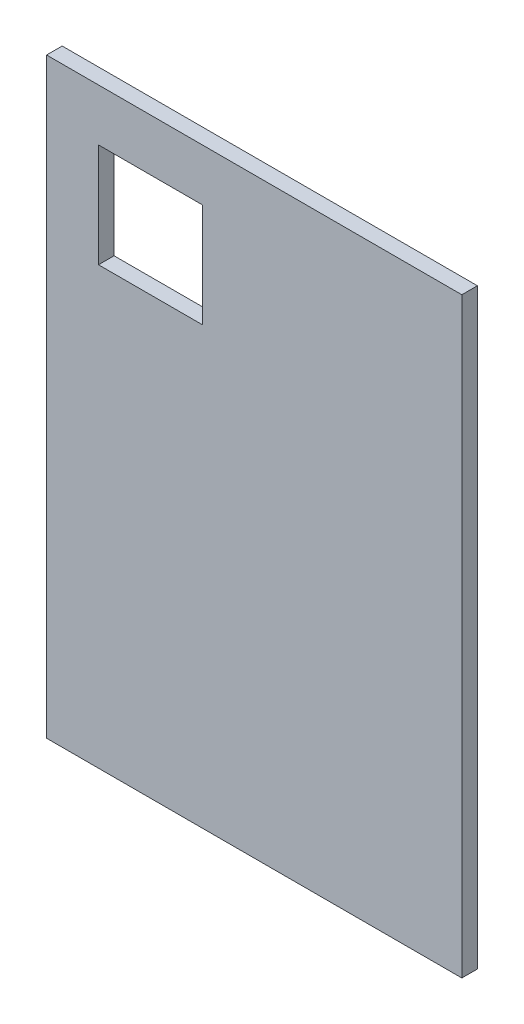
ISO-10303-21;
HEADER;
FILE_DESCRIPTION(('STEP AP214'),'2;1');
FILE_NAME('part.step','',(''),(''),'','','');
FILE_SCHEMA(('AUTOMOTIVE_DESIGN { 1 0 10303 214 1 1 1 1 }'));
ENDSEC;
DATA;
#1=APPLICATION_CONTEXT('core data for automotive mechanical design processes');
#2=APPLICATION_PROTOCOL_DEFINITION('international standard','automotive_design',2000,#1);
#3=PRODUCT_CONTEXT('',#1,'mechanical');
#4=PRODUCT('Part','Part','',(#3));
#5=PRODUCT_RELATED_PRODUCT_CATEGORY('part','',(#4));
#6=PRODUCT_DEFINITION_FORMATION('','',#4);
#7=PRODUCT_DEFINITION_CONTEXT('part definition',#1,'design');
#8=PRODUCT_DEFINITION('design','',#6,#7);
#9=PRODUCT_DEFINITION_SHAPE('','',#8);
#10=(LENGTH_UNIT() NAMED_UNIT(*) SI_UNIT(.MILLI.,.METRE.));
#11=(NAMED_UNIT(*) PLANE_ANGLE_UNIT() SI_UNIT($,.RADIAN.));
#12=(NAMED_UNIT(*) SI_UNIT($,.STERADIAN.) SOLID_ANGLE_UNIT());
#13=UNCERTAINTY_MEASURE_WITH_UNIT(LENGTH_MEASURE(1.E-05),#10,'distance_accuracy_value','');
#14=(GEOMETRIC_REPRESENTATION_CONTEXT(3) GLOBAL_UNCERTAINTY_ASSIGNED_CONTEXT((#13)) GLOBAL_UNIT_ASSIGNED_CONTEXT((#10,
#11,#12)) REPRESENTATION_CONTEXT('',''));
#15=CARTESIAN_POINT('',(0.,0.,0.));
#16=DIRECTION('',(0.,0.,1.));
#17=DIRECTION('',(1.,0.,0.));
#18=AXIS2_PLACEMENT_3D('',#15,#16,#17);
#19=CARTESIAN_POINT('',(200.,285.,15.));
#20=DIRECTION('',(-1.,0.,0.));
#21=DIRECTION('',(0.,-1.,0.));
#22=AXIS2_PLACEMENT_3D('',#19,#20,#21);
#23=PLANE('',#22);
#24=DIRECTION('',(0.,1.,0.));
#25=VECTOR('',#24,1.);
#26=CARTESIAN_POINT('',(200.,285.,0.));
#27=LINE('',#26,#25);
#28=CARTESIAN_POINT('',(200.,-285.,0.));
#29=VERTEX_POINT('',#28);
#30=CARTESIAN_POINT('',(200.,285.,0.));
#31=VERTEX_POINT('',#30);
#32=EDGE_CURVE('E151',#29,#31,#27,.T.);
#33=ORIENTED_EDGE('',*,*,#32,.T.);
#34=DIRECTION('',(0.,0.,-1.));
#35=VECTOR('',#34,1.);
#36=CARTESIAN_POINT('',(200.,285.,15.));
#37=LINE('',#36,#35);
#38=CARTESIAN_POINT('',(200.,285.,15.));
#39=VERTEX_POINT('',#38);
#40=EDGE_CURVE('E11',#39,#31,#37,.T.);
#41=ORIENTED_EDGE('',*,*,#40,.F.);
#42=DIRECTION('',(0.,1.,0.));
#43=VECTOR('',#42,1.);
#44=CARTESIAN_POINT('',(200.,285.,15.));
#45=LINE('',#44,#43);
#46=CARTESIAN_POINT('',(200.,-285.,15.));
#47=VERTEX_POINT('',#46);
#48=EDGE_CURVE('E157',#47,#39,#45,.T.);
#49=ORIENTED_EDGE('',*,*,#48,.F.);
#50=DIRECTION('',(0.,0.,-1.));
#51=VECTOR('',#50,1.);
#52=CARTESIAN_POINT('',(200.,-285.,15.));
#53=LINE('',#52,#51);
#54=EDGE_CURVE('E171',#47,#29,#53,.T.);
#55=ORIENTED_EDGE('',*,*,#54,.T.);
#56=EDGE_LOOP('',(#33,#41,#49,#55));
#57=FACE_BOUND('',#56,.T.);
#58=ADVANCED_FACE('F43',(#57),#23,.F.);
#59=CARTESIAN_POINT('',(-200.,285.,15.));
#60=DIRECTION('',(0.,-1.,0.));
#61=DIRECTION('',(0.,0.,-1.));
#62=AXIS2_PLACEMENT_3D('',#59,#60,#61);
#63=PLANE('',#62);
#64=DIRECTION('',(-1.,0.,0.));
#65=VECTOR('',#64,1.);
#66=CARTESIAN_POINT('',(-200.,285.,0.));
#67=LINE('',#66,#65);
#68=CARTESIAN_POINT('',(-200.,285.,0.));
#69=VERTEX_POINT('',#68);
#70=EDGE_CURVE('E175',#31,#69,#67,.T.);
#71=ORIENTED_EDGE('',*,*,#70,.T.);
#72=DIRECTION('',(0.,0.,-1.));
#73=VECTOR('',#72,1.);
#74=CARTESIAN_POINT('',(-200.,285.,15.));
#75=LINE('',#74,#73);
#76=CARTESIAN_POINT('',(-200.,285.,15.));
#77=VERTEX_POINT('',#76);
#78=EDGE_CURVE('E51',#77,#69,#75,.T.);
#79=ORIENTED_EDGE('',*,*,#78,.F.);
#80=DIRECTION('',(-1.,0.,0.));
#81=VECTOR('',#80,1.);
#82=CARTESIAN_POINT('',(-200.,285.,15.));
#83=LINE('',#82,#81);
#84=EDGE_CURVE('E161',#39,#77,#83,.T.);
#85=ORIENTED_EDGE('',*,*,#84,.F.);
#86=ORIENTED_EDGE('',*,*,#40,.T.);
#87=EDGE_LOOP('',(#71,#79,#85,#86));
#88=FACE_BOUND('',#87,.T.);
#89=ADVANCED_FACE('F209',(#88),#63,.F.);
#90=CARTESIAN_POINT('',(-200.,285.,15.));
#91=DIRECTION('',(1.,0.,0.));
#92=DIRECTION('',(0.,1.,0.));
#93=AXIS2_PLACEMENT_3D('',#90,#91,#92);
#94=PLANE('',#93);
#95=DIRECTION('',(0.,-1.,0.));
#96=VECTOR('',#95,1.);
#97=CARTESIAN_POINT('',(-200.,285.,0.));
#98=LINE('',#97,#96);
#99=CARTESIAN_POINT('',(-200.,-285.,0.));
#100=VERTEX_POINT('',#99);
#101=EDGE_CURVE('E178',#69,#100,#98,.T.);
#102=ORIENTED_EDGE('',*,*,#101,.T.);
#103=DIRECTION('',(0.,0.,-1.));
#104=VECTOR('',#103,1.);
#105=CARTESIAN_POINT('',(-200.,-285.,15.));
#106=LINE('',#105,#104);
#107=CARTESIAN_POINT('',(-200.,-285.,15.));
#108=VERTEX_POINT('',#107);
#109=EDGE_CURVE('E186',#108,#100,#106,.T.);
#110=ORIENTED_EDGE('',*,*,#109,.F.);
#111=DIRECTION('',(0.,-1.,0.));
#112=VECTOR('',#111,1.);
#113=CARTESIAN_POINT('',(-200.,285.,15.));
#114=LINE('',#113,#112);
#115=EDGE_CURVE('E165',#77,#108,#114,.T.);
#116=ORIENTED_EDGE('',*,*,#115,.F.);
#117=ORIENTED_EDGE('',*,*,#78,.T.);
#118=EDGE_LOOP('',(#102,#110,#116,#117));
#119=FACE_BOUND('',#118,.T.);
#120=ADVANCED_FACE('F195',(#119),#94,.F.);
#121=CARTESIAN_POINT('',(-200.,-285.,15.));
#122=DIRECTION('',(0.,1.,0.));
#123=DIRECTION('',(0.,0.,1.));
#124=AXIS2_PLACEMENT_3D('',#121,#122,#123);
#125=PLANE('',#124);
#126=DIRECTION('',(1.,0.,0.));
#127=VECTOR('',#126,1.);
#128=CARTESIAN_POINT('',(-200.,-285.,0.));
#129=LINE('',#128,#127);
#130=EDGE_CURVE('E162',#100,#29,#129,.T.);
#131=ORIENTED_EDGE('',*,*,#130,.T.);
#132=ORIENTED_EDGE('',*,*,#54,.F.);
#133=DIRECTION('',(1.,0.,0.));
#134=VECTOR('',#133,1.);
#135=CARTESIAN_POINT('',(-200.,-285.,15.));
#136=LINE('',#135,#134);
#137=EDGE_CURVE('E168',#108,#47,#136,.T.);
#138=ORIENTED_EDGE('',*,*,#137,.F.);
#139=ORIENTED_EDGE('',*,*,#109,.T.);
#140=EDGE_LOOP('',(#131,#132,#138,#139));
#141=FACE_BOUND('',#140,.T.);
#142=ADVANCED_FACE('F202',(#141),#125,.F.);
#143=CARTESIAN_POINT('',(0.,0.,15.));
#144=DIRECTION('',(0.,0.,1.));
#145=DIRECTION('',(1.,0.,0.));
#146=AXIS2_PLACEMENT_3D('',#143,#144,#145);
#147=PLANE('',#146);
#148=DIRECTION('',(0.,1.,0.));
#149=VECTOR('',#148,1.);
#150=CARTESIAN_POINT('',(-50.0000000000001,235.,15.));
#151=LINE('',#150,#149);
#152=CARTESIAN_POINT('',(-50.0000000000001,135.,15.));
#153=VERTEX_POINT('',#152);
#154=CARTESIAN_POINT('',(-50.0000000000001,235.,15.));
#155=VERTEX_POINT('',#154);
#156=EDGE_CURVE('E58',#153,#155,#151,.T.);
#157=ORIENTED_EDGE('',*,*,#156,.F.);
#158=DIRECTION('',(1.,0.,0.));
#159=VECTOR('',#158,1.);
#160=CARTESIAN_POINT('',(-150.,135.,15.));
#161=LINE('',#160,#159);
#162=CARTESIAN_POINT('',(-150.,135.,15.));
#163=VERTEX_POINT('',#162);
#164=EDGE_CURVE('E129',#163,#153,#161,.T.);
#165=ORIENTED_EDGE('',*,*,#164,.F.);
#166=DIRECTION('',(0.,-1.,0.));
#167=VECTOR('',#166,1.);
#168=CARTESIAN_POINT('',(-150.,235.,15.));
#169=LINE('',#168,#167);
#170=CARTESIAN_POINT('',(-150.,235.,15.));
#171=VERTEX_POINT('',#170);
#172=EDGE_CURVE('E133',#171,#163,#169,.T.);
#173=ORIENTED_EDGE('',*,*,#172,.F.);
#174=DIRECTION('',(-1.,0.,0.));
#175=VECTOR('',#174,1.);
#176=CARTESIAN_POINT('',(-150.,235.,15.));
#177=LINE('',#176,#175);
#178=EDGE_CURVE('E142',#155,#171,#177,.T.);
#179=ORIENTED_EDGE('',*,*,#178,.F.);
#180=EDGE_LOOP('',(#157,#165,#173,#179));
#181=FACE_BOUND('',#180,.T.);
#182=ORIENTED_EDGE('',*,*,#48,.T.);
#183=ORIENTED_EDGE('',*,*,#84,.T.);
#184=ORIENTED_EDGE('',*,*,#115,.T.);
#185=ORIENTED_EDGE('',*,*,#137,.T.);
#186=EDGE_LOOP('',(#182,#183,#184,#185));
#187=FACE_BOUND('',#186,.T.);
#188=ADVANCED_FACE('F208',(#181,#187),#147,.T.);
#189=CARTESIAN_POINT('',(0.,0.,0.));
#190=DIRECTION('',(0.,0.,1.));
#191=DIRECTION('',(1.,0.,0.));
#192=AXIS2_PLACEMENT_3D('',#189,#190,#191);
#193=PLANE('',#192);
#194=DIRECTION('',(1.,0.,0.));
#195=VECTOR('',#194,1.);
#196=CARTESIAN_POINT('',(-150.,135.,0.));
#197=LINE('',#196,#195);
#198=CARTESIAN_POINT('',(-150.,135.,0.));
#199=VERTEX_POINT('',#198);
#200=CARTESIAN_POINT('',(-50.0000000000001,135.,0.));
#201=VERTEX_POINT('',#200);
#202=EDGE_CURVE('E117',#199,#201,#197,.T.);
#203=ORIENTED_EDGE('',*,*,#202,.T.);
#204=DIRECTION('',(0.,1.,0.));
#205=VECTOR('',#204,1.);
#206=CARTESIAN_POINT('',(-50.0000000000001,235.,0.));
#207=LINE('',#206,#205);
#208=CARTESIAN_POINT('',(-50.0000000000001,235.,0.));
#209=VERTEX_POINT('',#208);
#210=EDGE_CURVE('E110',#201,#209,#207,.T.);
#211=ORIENTED_EDGE('',*,*,#210,.T.);
#212=DIRECTION('',(-1.,0.,0.));
#213=VECTOR('',#212,1.);
#214=CARTESIAN_POINT('',(-150.,235.,0.));
#215=LINE('',#214,#213);
#216=CARTESIAN_POINT('',(-150.,235.,0.));
#217=VERTEX_POINT('',#216);
#218=EDGE_CURVE('E120',#209,#217,#215,.T.);
#219=ORIENTED_EDGE('',*,*,#218,.T.);
#220=DIRECTION('',(0.,-1.,0.));
#221=VECTOR('',#220,1.);
#222=CARTESIAN_POINT('',(-150.,235.,0.));
#223=LINE('',#222,#221);
#224=EDGE_CURVE('E66',#217,#199,#223,.T.);
#225=ORIENTED_EDGE('',*,*,#224,.T.);
#226=EDGE_LOOP('',(#203,#211,#219,#225));
#227=FACE_BOUND('',#226,.T.);
#228=ORIENTED_EDGE('',*,*,#32,.F.);
#229=ORIENTED_EDGE('',*,*,#130,.F.);
#230=ORIENTED_EDGE('',*,*,#101,.F.);
#231=ORIENTED_EDGE('',*,*,#70,.F.);
#232=EDGE_LOOP('',(#228,#229,#230,#231));
#233=FACE_BOUND('',#232,.T.);
#234=ADVANCED_FACE('F125',(#227,#233),#193,.F.);
#235=CARTESIAN_POINT('',(-50.0000000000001,235.,0.));
#236=DIRECTION('',(1.,0.,0.));
#237=DIRECTION('',(0.,0.,-1.));
#238=AXIS2_PLACEMENT_3D('',#235,#236,#237);
#239=PLANE('',#238);
#240=ORIENTED_EDGE('',*,*,#156,.T.);
#241=DIRECTION('',(0.,0.,1.));
#242=VECTOR('',#241,1.);
#243=CARTESIAN_POINT('',(-50.0000000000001,235.,0.));
#244=LINE('',#243,#242);
#245=EDGE_CURVE('E106',#209,#155,#244,.T.);
#246=ORIENTED_EDGE('',*,*,#245,.F.);
#247=ORIENTED_EDGE('',*,*,#210,.F.);
#248=DIRECTION('',(0.,0.,1.));
#249=VECTOR('',#248,1.);
#250=CARTESIAN_POINT('',(-50.0000000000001,135.,0.));
#251=LINE('',#250,#249);
#252=EDGE_CURVE('E148',#201,#153,#251,.T.);
#253=ORIENTED_EDGE('',*,*,#252,.T.);
#254=EDGE_LOOP('',(#240,#246,#247,#253));
#255=FACE_BOUND('',#254,.T.);
#256=ADVANCED_FACE('F108',(#255),#239,.F.);
#257=CARTESIAN_POINT('',(-150.,135.,0.));
#258=DIRECTION('',(0.,-1.,0.));
#259=DIRECTION('',(0.,0.,-1.));
#260=AXIS2_PLACEMENT_3D('',#257,#258,#259);
#261=PLANE('',#260);
#262=ORIENTED_EDGE('',*,*,#164,.T.);
#263=ORIENTED_EDGE('',*,*,#252,.F.);
#264=ORIENTED_EDGE('',*,*,#202,.F.);
#265=DIRECTION('',(0.,0.,1.));
#266=VECTOR('',#265,1.);
#267=CARTESIAN_POINT('',(-150.,135.,0.));
#268=LINE('',#267,#266);
#269=EDGE_CURVE('E152',#199,#163,#268,.T.);
#270=ORIENTED_EDGE('',*,*,#269,.T.);
#271=EDGE_LOOP('',(#262,#263,#264,#270));
#272=FACE_BOUND('',#271,.T.);
#273=ADVANCED_FACE('F226',(#272),#261,.F.);
#274=CARTESIAN_POINT('',(-150.,235.,0.));
#275=DIRECTION('',(-1.,0.,0.));
#276=DIRECTION('',(0.,0.,1.));
#277=AXIS2_PLACEMENT_3D('',#274,#275,#276);
#278=PLANE('',#277);
#279=ORIENTED_EDGE('',*,*,#172,.T.);
#280=ORIENTED_EDGE('',*,*,#269,.F.);
#281=ORIENTED_EDGE('',*,*,#224,.F.);
#282=DIRECTION('',(0.,0.,1.));
#283=VECTOR('',#282,1.);
#284=CARTESIAN_POINT('',(-150.,235.,0.));
#285=LINE('',#284,#283);
#286=EDGE_CURVE('E116',#217,#171,#285,.T.);
#287=ORIENTED_EDGE('',*,*,#286,.T.);
#288=EDGE_LOOP('',(#279,#280,#281,#287));
#289=FACE_BOUND('',#288,.T.);
#290=ADVANCED_FACE('F229',(#289),#278,.F.);
#291=CARTESIAN_POINT('',(-150.,235.,0.));
#292=DIRECTION('',(0.,1.,0.));
#293=DIRECTION('',(0.,0.,1.));
#294=AXIS2_PLACEMENT_3D('',#291,#292,#293);
#295=PLANE('',#294);
#296=ORIENTED_EDGE('',*,*,#178,.T.);
#297=ORIENTED_EDGE('',*,*,#286,.F.);
#298=ORIENTED_EDGE('',*,*,#218,.F.);
#299=ORIENTED_EDGE('',*,*,#245,.T.);
#300=EDGE_LOOP('',(#296,#297,#298,#299));
#301=FACE_BOUND('',#300,.T.);
#302=ADVANCED_FACE('F121',(#301),#295,.F.);
#303=CLOSED_SHELL('',(#58,#89,#120,#142,#188,#234,#256,#273,#290,#302));
#304=MANIFOLD_SOLID_BREP('B2',#303);
#305=ADVANCED_BREP_SHAPE_REPRESENTATION('',(#18,#304),#14);
#306=SHAPE_DEFINITION_REPRESENTATION(#9,#305);
ENDSEC;
END-ISO-10303-21;
